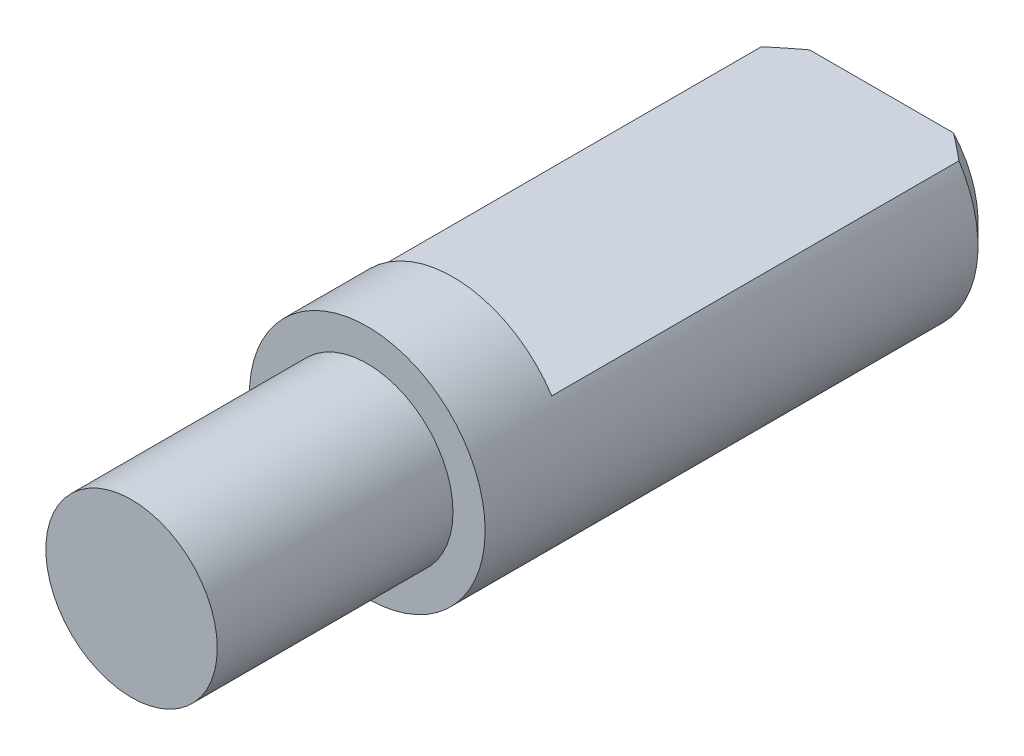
from build123d import *

# Parameters (mm, degrees)
ESQUISSE7_R             = 12.5
EXTRUSION2_DEPTH        = 70
ESQUISSE1_OUTSIDE_W     = 42.684
ESQUISSE1_OUTSIDE_H     = 42.684
ESQUISSE1_OUTSIDE_R     = 11
ENL_V_MAT_EXTRU_1_DEPTH = 48
CHANFREIN1_SIZE         = 2
ESQUISSE8_OUTSIDE_W     = 42.684
ESQUISSE8_OUTSIDE_H     = 42.684
ESQUISSE8_OUTSIDE_R     = 8
ENL_V_MAT_EXTRU_3_DEPTH = 22
ESQUISSE3_W             = 40.488979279
ESQUISSE3_H             = 44.611493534
ENL_V_MAT_EXTRU_2_DEPTH = 48


with BuildPart() as part:
    # Esquisse7 → Extrusion2 (new body)
    with BuildSketch(Plane.XY):
        Circle(ESQUISSE7_R)
    extrude(amount=EXTRUSION2_DEPTH)

    # Esquisse1 outside → Enl_v. mat.-Extru.1 (cut)
    with BuildSketch(Plane.XY):
        Rectangle(ESQUISSE1_OUTSIDE_W, ESQUISSE1_OUTSIDE_H)
        Circle(ESQUISSE1_OUTSIDE_R, mode=Mode.SUBTRACT)
    extrude(amount=ENL_V_MAT_EXTRU_1_DEPTH, mode=Mode.SUBTRACT)

    # Chanfrein1
    chanfrein1_edges = [part.edges().sort_by_distance(p)[0] for p in [
        (-11, 0, 0),
    ]]
    chamfer(chanfrein1_edges, length=CHANFREIN1_SIZE)

    # Esquisse8 outside → Enl_v. mat.-Extru.3 (cut)
    with BuildSketch(Plane.XY.offset(70)):
        Rectangle(ESQUISSE8_OUTSIDE_W, ESQUISSE8_OUTSIDE_H)
        Circle(ESQUISSE8_OUTSIDE_R, mode=Mode.SUBTRACT)
    extrude(amount=-ENL_V_MAT_EXTRU_3_DEPTH, mode=Mode.SUBTRACT)

    # Esquisse3 → Enl_v. mat.-Extru.2 (cut)
    with BuildSketch(Plane(origin=(0, 6, 0), x_dir=(-1, 0, 0), z_dir=(0, 1, 0))):
        with Locations((-1.10424489, 17.694253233)):
            Rectangle(ESQUISSE3_W, ESQUISSE3_H)
    extrude(amount=ENL_V_MAT_EXTRU_2_DEPTH, mode=Mode.SUBTRACT)


solid = part.part
